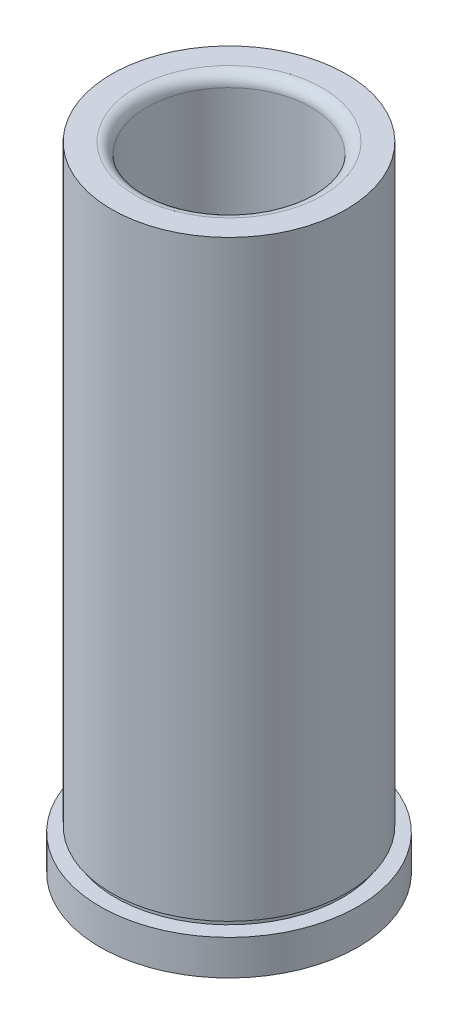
ISO-10303-21;
HEADER;
FILE_DESCRIPTION(('STEP AP214'),'2;1');
FILE_NAME('part.step','',(''),(''),'','','');
FILE_SCHEMA(('AUTOMOTIVE_DESIGN { 1 0 10303 214 1 1 1 1 }'));
ENDSEC;
DATA;
#1=APPLICATION_CONTEXT('core data for automotive mechanical design processes');
#2=APPLICATION_PROTOCOL_DEFINITION('international standard','automotive_design',2000,#1);
#3=PRODUCT_CONTEXT('',#1,'mechanical');
#4=PRODUCT('Part','Part','',(#3));
#5=PRODUCT_RELATED_PRODUCT_CATEGORY('part','',(#4));
#6=PRODUCT_DEFINITION_FORMATION('','',#4);
#7=PRODUCT_DEFINITION_CONTEXT('part definition',#1,'design');
#8=PRODUCT_DEFINITION('design','',#6,#7);
#9=PRODUCT_DEFINITION_SHAPE('','',#8);
#10=(LENGTH_UNIT() NAMED_UNIT(*) SI_UNIT(.MILLI.,.METRE.));
#11=(NAMED_UNIT(*) PLANE_ANGLE_UNIT() SI_UNIT($,.RADIAN.));
#12=(NAMED_UNIT(*) SI_UNIT($,.STERADIAN.) SOLID_ANGLE_UNIT());
#13=UNCERTAINTY_MEASURE_WITH_UNIT(LENGTH_MEASURE(1.E-05),#10,'distance_accuracy_value','');
#14=(GEOMETRIC_REPRESENTATION_CONTEXT(3) GLOBAL_UNCERTAINTY_ASSIGNED_CONTEXT((#13)) GLOBAL_UNIT_ASSIGNED_CONTEXT((#10,
#11,#12)) REPRESENTATION_CONTEXT('',''));
#15=CARTESIAN_POINT('',(0.,0.,0.));
#16=DIRECTION('',(0.,0.,1.));
#17=DIRECTION('',(1.,0.,0.));
#18=AXIS2_PLACEMENT_3D('',#15,#16,#17);
#19=CARTESIAN_POINT('',(-15.88135,85.7249999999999,0.));
#20=DIRECTION('',(0.,-1.,0.));
#21=DIRECTION('',(1.,0.,0.));
#22=AXIS2_PLACEMENT_3D('',#19,#20,#21);
#23=PLANE('',#22);
#24=CARTESIAN_POINT('',(-2.99307411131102E-13,85.725,0.));
#25=DIRECTION('',(0.,-1.,0.));
#26=DIRECTION('',(1.,0.,0.));
#27=AXIS2_PLACEMENT_3D('',#24,#25,#26);
#28=CIRCLE('',#27,12.6428499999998);
#29=CARTESIAN_POINT('',(12.6428499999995,85.725,0.));
#30=VERTEX_POINT('',#29);
#31=EDGE_CURVE('E36',#30,#30,#28,.T.);
#32=ORIENTED_EDGE('',*,*,#31,.T.);
#33=EDGE_LOOP('',(#32));
#34=FACE_BOUND('',#33,.T.);
#35=CARTESIAN_POINT('',(-2.99307411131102E-13,85.7250000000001,0.));
#36=DIRECTION('',(0.,-1.,0.));
#37=DIRECTION('',(1.,0.,0.));
#38=AXIS2_PLACEMENT_3D('',#35,#36,#37);
#39=CIRCLE('',#38,15.8813499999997);
#40=CARTESIAN_POINT('',(15.8813499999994,85.7250000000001,0.));
#41=VERTEX_POINT('',#40);
#42=EDGE_CURVE('E40',#41,#41,#39,.T.);
#43=ORIENTED_EDGE('',*,*,#42,.F.);
#44=EDGE_LOOP('',(#43));
#45=FACE_BOUND('',#44,.T.);
#46=ADVANCED_FACE('F29',(#34,#45),#23,.F.);
#47=CARTESIAN_POINT('',(3.49148336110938E-12,-1000.,0.));
#48=DIRECTION('',(0.,-1.,0.));
#49=DIRECTION('',(1.,0.,0.));
#50=AXIS2_PLACEMENT_3D('',#47,#48,#49);
#51=CYLINDRICAL_SURFACE('',#50,15.8813499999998);
#52=CARTESIAN_POINT('',(0.,5.52449999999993,0.));
#53=DIRECTION('',(0.,-1.,0.));
#54=DIRECTION('',(1.,0.,0.));
#55=AXIS2_PLACEMENT_3D('',#52,#53,#54);
#56=CIRCLE('',#55,15.88135);
#57=CARTESIAN_POINT('',(15.8813499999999,5.52449999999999,0.));
#58=VERTEX_POINT('',#57);
#59=EDGE_CURVE('E44',#58,#58,#56,.T.);
#60=ORIENTED_EDGE('',*,*,#59,.F.);
#61=EDGE_LOOP('',(#60));
#62=FACE_BOUND('',#61,.T.);
#63=ORIENTED_EDGE('',*,*,#42,.T.);
#64=EDGE_LOOP('',(#63));
#65=FACE_BOUND('',#64,.T.);
#66=ADVANCED_FACE('F121',(#62,#65),#51,.T.);
#67=CARTESIAN_POINT('',(-15.88135,5.5244999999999,0.));
#68=DIRECTION('',(0.,1.,0.));
#69=DIRECTION('',(-1.,0.,0.));
#70=AXIS2_PLACEMENT_3D('',#67,#68,#69);
#71=PLANE('',#70);
#72=CARTESIAN_POINT('',(0.,5.52449999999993,0.));
#73=DIRECTION('',(0.,-1.,0.));
#74=DIRECTION('',(1.,0.,0.));
#75=AXIS2_PLACEMENT_3D('',#72,#73,#74);
#76=CIRCLE('',#75,15.37335);
#77=CARTESIAN_POINT('',(15.37335,5.52449999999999,0.));
#78=VERTEX_POINT('',#77);
#79=EDGE_CURVE('E49',#78,#78,#76,.T.);
#80=ORIENTED_EDGE('',*,*,#79,.F.);
#81=EDGE_LOOP('',(#80));
#82=FACE_BOUND('',#81,.T.);
#83=ORIENTED_EDGE('',*,*,#59,.T.);
#84=EDGE_LOOP('',(#83));
#85=FACE_BOUND('',#84,.T.);
#86=ADVANCED_FACE('F115',(#82,#85),#71,.F.);
#87=CARTESIAN_POINT('',(3.49148336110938E-12,-1000.,0.));
#88=DIRECTION('',(0.,-1.,0.));
#89=DIRECTION('',(1.,0.,0.));
#90=AXIS2_PLACEMENT_3D('',#87,#88,#89);
#91=CYLINDRICAL_SURFACE('',#90,15.37335);
#92=CARTESIAN_POINT('',(0.,4.7625,0.));
#93=DIRECTION('',(0.,-1.,0.));
#94=DIRECTION('',(1.,0.,0.));
#95=AXIS2_PLACEMENT_3D('',#92,#93,#94);
#96=CIRCLE('',#95,15.37335);
#97=CARTESIAN_POINT('',(15.37335,4.76250000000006,0.));
#98=VERTEX_POINT('',#97);
#99=EDGE_CURVE('E52',#98,#98,#96,.T.);
#100=ORIENTED_EDGE('',*,*,#99,.F.);
#101=EDGE_LOOP('',(#100));
#102=FACE_BOUND('',#101,.T.);
#103=ORIENTED_EDGE('',*,*,#79,.T.);
#104=EDGE_LOOP('',(#103));
#105=FACE_BOUND('',#104,.T.);
#106=ADVANCED_FACE('F109',(#102,#105),#91,.T.);
#107=CARTESIAN_POINT('',(-17.4625,4.7624999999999,0.));
#108=DIRECTION('',(0.,-1.,0.));
#109=DIRECTION('',(1.,0.,0.));
#110=AXIS2_PLACEMENT_3D('',#107,#108,#109);
#111=PLANE('',#110);
#112=CARTESIAN_POINT('',(0.,4.7625,0.));
#113=DIRECTION('',(0.,-1.,0.));
#114=DIRECTION('',(1.,0.,0.));
#115=AXIS2_PLACEMENT_3D('',#112,#113,#114);
#116=CIRCLE('',#115,17.4625);
#117=CARTESIAN_POINT('',(17.4625,4.76250000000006,0.));
#118=VERTEX_POINT('',#117);
#119=EDGE_CURVE('E55',#118,#118,#116,.T.);
#120=ORIENTED_EDGE('',*,*,#119,.F.);
#121=EDGE_LOOP('',(#120));
#122=FACE_BOUND('',#121,.T.);
#123=ORIENTED_EDGE('',*,*,#99,.T.);
#124=EDGE_LOOP('',(#123));
#125=FACE_BOUND('',#124,.T.);
#126=ADVANCED_FACE('F103',(#122,#125),#111,.F.);
#127=CARTESIAN_POINT('',(3.49148336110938E-12,-1000.,0.));
#128=DIRECTION('',(0.,-1.,0.));
#129=DIRECTION('',(1.,0.,0.));
#130=AXIS2_PLACEMENT_3D('',#127,#128,#129);
#131=CYLINDRICAL_SURFACE('',#130,17.4625);
#132=CARTESIAN_POINT('',(0.,0.,0.));
#133=DIRECTION('',(0.,-1.,0.));
#134=DIRECTION('',(1.,0.,0.));
#135=AXIS2_PLACEMENT_3D('',#132,#133,#134);
#136=CIRCLE('',#135,17.4625);
#137=CARTESIAN_POINT('',(17.4625,0.,0.));
#138=VERTEX_POINT('',#137);
#139=EDGE_CURVE('E58',#138,#138,#136,.T.);
#140=ORIENTED_EDGE('',*,*,#139,.F.);
#141=EDGE_LOOP('',(#140));
#142=FACE_BOUND('',#141,.T.);
#143=ORIENTED_EDGE('',*,*,#119,.T.);
#144=EDGE_LOOP('',(#143));
#145=FACE_BOUND('',#144,.T.);
#146=ADVANCED_FACE('F97',(#142,#145),#131,.T.);
#147=CARTESIAN_POINT('',(-13.1826,0.,0.));
#148=DIRECTION('',(0.,1.,0.));
#149=DIRECTION('',(-1.,0.,0.));
#150=AXIS2_PLACEMENT_3D('',#147,#148,#149);
#151=PLANE('',#150);
#152=CARTESIAN_POINT('',(0.,0.,0.));
#153=DIRECTION('',(0.,-1.,0.));
#154=DIRECTION('',(1.,0.,0.));
#155=AXIS2_PLACEMENT_3D('',#152,#153,#154);
#156=CIRCLE('',#155,13.1826);
#157=CARTESIAN_POINT('',(13.1826,0.,0.));
#158=VERTEX_POINT('',#157);
#159=EDGE_CURVE('E61',#158,#158,#156,.T.);
#160=ORIENTED_EDGE('',*,*,#159,.F.);
#161=EDGE_LOOP('',(#160));
#162=FACE_BOUND('',#161,.T.);
#163=ORIENTED_EDGE('',*,*,#139,.T.);
#164=EDGE_LOOP('',(#163));
#165=FACE_BOUND('',#164,.T.);
#166=ADVANCED_FACE('F91',(#162,#165),#151,.F.);
#167=CARTESIAN_POINT('',(0.,0.,0.));
#168=DIRECTION('',(0.,-1.,0.));
#169=DIRECTION('',(1.,0.,0.));
#170=AXIS2_PLACEMENT_3D('',#167,#168,#169);
#171=CONICAL_SURFACE('',#170,13.1826,0.785398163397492);
#172=CARTESIAN_POINT('',(0.,0.793749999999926,0.));
#173=DIRECTION('',(0.,-1.,0.));
#174=DIRECTION('',(1.,0.,0.));
#175=AXIS2_PLACEMENT_3D('',#172,#173,#174);
#176=CIRCLE('',#175,12.38885);
#177=CARTESIAN_POINT('',(12.38885,0.79374999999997,0.));
#178=VERTEX_POINT('',#177);
#179=EDGE_CURVE('E64',#178,#178,#176,.T.);
#180=ORIENTED_EDGE('',*,*,#179,.F.);
#181=EDGE_LOOP('',(#180));
#182=FACE_BOUND('',#181,.T.);
#183=ORIENTED_EDGE('',*,*,#159,.T.);
#184=EDGE_LOOP('',(#183));
#185=FACE_BOUND('',#184,.T.);
#186=ADVANCED_FACE('F85',(#182,#185),#171,.F.);
#187=CARTESIAN_POINT('',(3.49148336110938E-12,-1000.,0.));
#188=DIRECTION('',(0.,-1.,0.));
#189=DIRECTION('',(1.,0.,0.));
#190=AXIS2_PLACEMENT_3D('',#187,#188,#189);
#191=CYLINDRICAL_SURFACE('',#190,12.3888499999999);
#192=CARTESIAN_POINT('',(-1.39676791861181E-13,40.0050000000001,0.));
#193=DIRECTION('',(0.,-1.,0.));
#194=DIRECTION('',(1.,0.,0.));
#195=AXIS2_PLACEMENT_3D('',#192,#193,#194);
#196=CIRCLE('',#195,12.3888499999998);
#197=CARTESIAN_POINT('',(12.3888499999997,40.0050000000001,0.));
#198=VERTEX_POINT('',#197);
#199=EDGE_CURVE('E67',#198,#198,#196,.T.);
#200=ORIENTED_EDGE('',*,*,#199,.F.);
#201=EDGE_LOOP('',(#200));
#202=FACE_BOUND('',#201,.T.);
#203=ORIENTED_EDGE('',*,*,#179,.T.);
#204=EDGE_LOOP('',(#203));
#205=FACE_BOUND('',#204,.T.);
#206=ADVANCED_FACE('F79',(#202,#205),#191,.F.);
#207=CARTESIAN_POINT('',(-1.38777878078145E-13,40.005,0.));
#208=DIRECTION('',(0.,-1.,0.));
#209=DIRECTION('',(1.,0.,0.));
#210=AXIS2_PLACEMENT_3D('',#207,#208,#209);
#211=TOROIDAL_SURFACE('',#210,11.1188499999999,1.26999999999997);
#212=CARTESIAN_POINT('',(-1.4411097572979E-13,41.2749999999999,0.));
#213=DIRECTION('',(0.,-1.,0.));
#214=DIRECTION('',(1.,0.,0.));
#215=AXIS2_PLACEMENT_3D('',#212,#213,#214);
#216=CIRCLE('',#215,11.1188499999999);
#217=CARTESIAN_POINT('',(11.1188499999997,41.275,0.));
#218=VERTEX_POINT('',#217);
#219=EDGE_CURVE('E70',#218,#218,#216,.T.);
#220=ORIENTED_EDGE('',*,*,#219,.F.);
#221=EDGE_LOOP('',(#220));
#222=FACE_BOUND('',#221,.T.);
#223=ORIENTED_EDGE('',*,*,#199,.T.);
#224=EDGE_LOOP('',(#223));
#225=FACE_BOUND('',#224,.T.);
#226=ADVANCED_FACE('F76',(#222,#225),#211,.F.);
#227=CARTESIAN_POINT('',(3.49148336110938E-12,-1000.,0.));
#228=DIRECTION('',(0.,-1.,0.));
#229=DIRECTION('',(1.,0.,0.));
#230=AXIS2_PLACEMENT_3D('',#227,#228,#229);
#231=CYLINDRICAL_SURFACE('',#230,11.1188499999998);
#232=CARTESIAN_POINT('',(-2.93986390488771E-13,84.201,0.));
#233=DIRECTION('',(0.,-1.,0.));
#234=DIRECTION('',(1.,0.,0.));
#235=AXIS2_PLACEMENT_3D('',#232,#233,#234);
#236=CIRCLE('',#235,11.1188499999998);
#237=CARTESIAN_POINT('',(11.1188499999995,84.201,0.));
#238=VERTEX_POINT('',#237);
#239=EDGE_CURVE('E10',#238,#238,#236,.F.);
#240=ORIENTED_EDGE('',*,*,#239,.T.);
#241=EDGE_LOOP('',(#240));
#242=FACE_BOUND('',#241,.T.);
#243=ORIENTED_EDGE('',*,*,#219,.T.);
#244=EDGE_LOOP('',(#243));
#245=FACE_BOUND('',#244,.T.);
#246=ADVANCED_FACE('F74',(#242,#245),#231,.F.);
#247=CARTESIAN_POINT('',(-2.93986390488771E-13,84.201,0.));
#248=DIRECTION('',(0.,-1.,0.));
#249=DIRECTION('',(1.,0.,0.));
#250=AXIS2_PLACEMENT_3D('',#247,#248,#249);
#251=TOROIDAL_SURFACE('',#250,12.6428499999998,1.524);
#252=ORIENTED_EDGE('',*,*,#239,.F.);
#253=EDGE_LOOP('',(#252));
#254=FACE_BOUND('',#253,.T.);
#255=ORIENTED_EDGE('',*,*,#31,.F.);
#256=EDGE_LOOP('',(#255));
#257=FACE_BOUND('',#256,.T.);
#258=ADVANCED_FACE('F31',(#254,#257),#251,.T.);
#259=CLOSED_SHELL('',(#46,#66,#86,#106,#126,#146,#166,#186,#206,#226,#246,#258));
#260=MANIFOLD_SOLID_BREP('B2',#259);
#261=ADVANCED_BREP_SHAPE_REPRESENTATION('',(#18,#260),#14);
#262=SHAPE_DEFINITION_REPRESENTATION(#9,#261);
ENDSEC;
END-ISO-10303-21;
